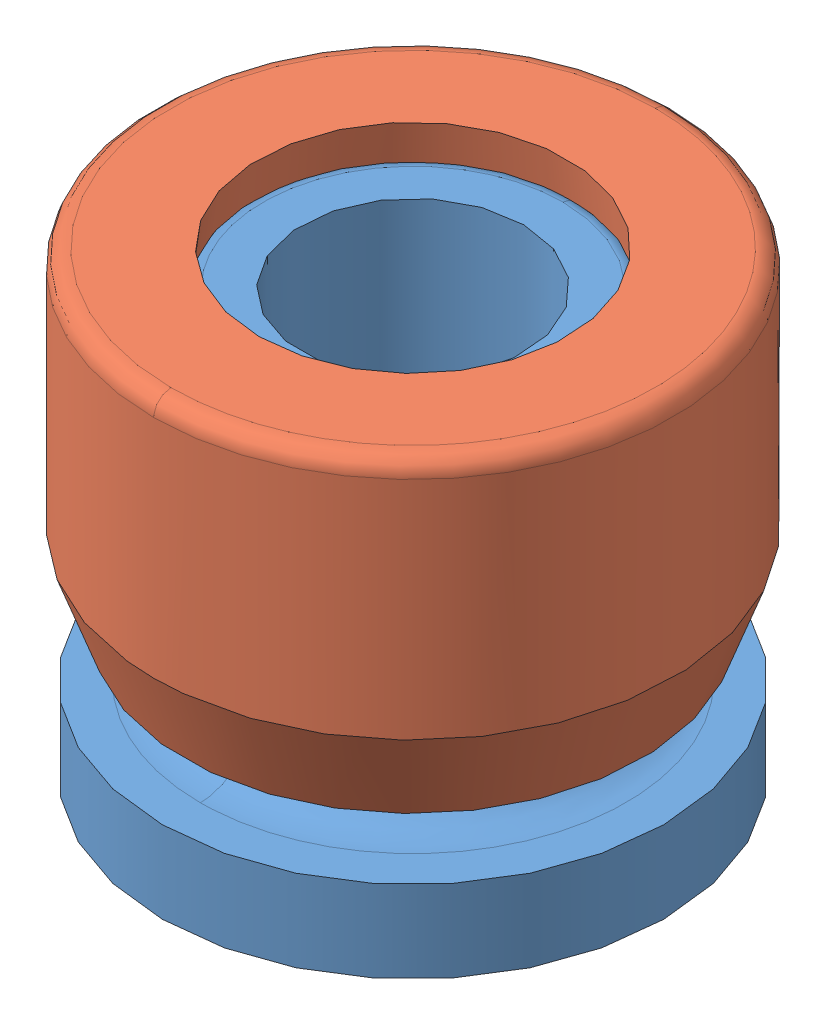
SolidWorks assembly M-250.SLDASM, configuration Défaut (file format 8000). Lengths in mm.
Overall size (3.81 3.35 3.81).
2 component instances, 2 part files, 0 mates.
Components (placement in the parent):
- M-250-01-1: M-250-01.sldprt [Défaut] at origin size (3.68 3.09 3.68)
- LT-100-02-1: LT-100-02.sldprt [Défaut] at (0 3.4344 0) x (0 1 0) z (0 0 1) size (2.41 3.81 3.81)
